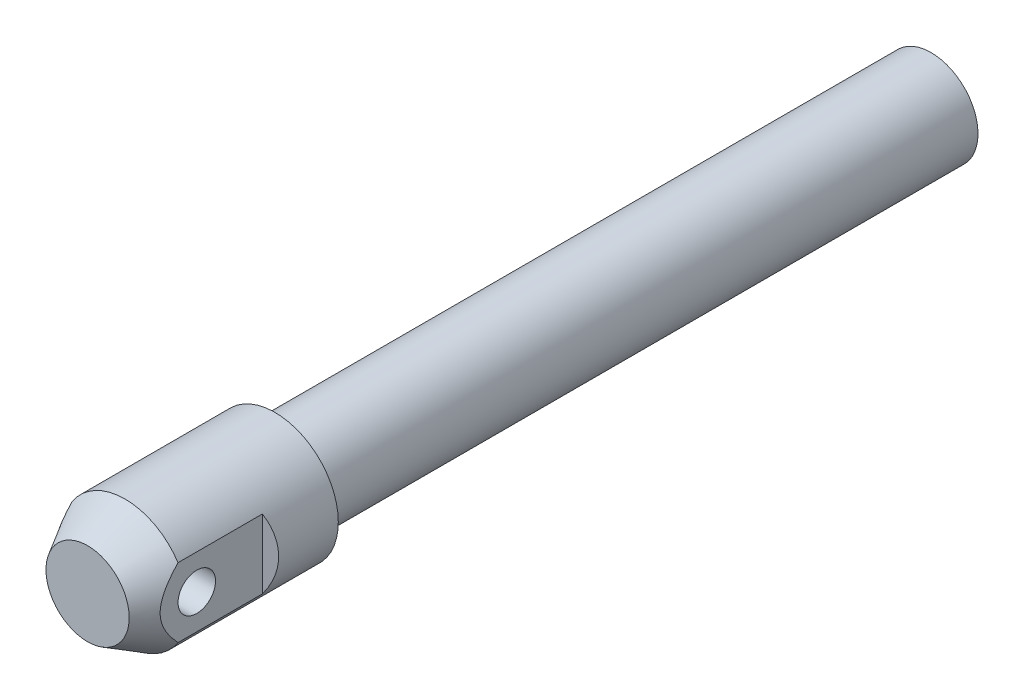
ISO-10303-21;
HEADER;
FILE_DESCRIPTION(('STEP AP214'),'2;1');
FILE_NAME('part.step','',(''),(''),'','','');
FILE_SCHEMA(('AUTOMOTIVE_DESIGN { 1 0 10303 214 1 1 1 1 }'));
ENDSEC;
DATA;
#1=APPLICATION_CONTEXT('core data for automotive mechanical design processes');
#2=APPLICATION_PROTOCOL_DEFINITION('international standard','automotive_design',2000,#1);
#3=PRODUCT_CONTEXT('',#1,'mechanical');
#4=PRODUCT('Part','Part','',(#3));
#5=PRODUCT_RELATED_PRODUCT_CATEGORY('part','',(#4));
#6=PRODUCT_DEFINITION_FORMATION('','',#4);
#7=PRODUCT_DEFINITION_CONTEXT('part definition',#1,'design');
#8=PRODUCT_DEFINITION('design','',#6,#7);
#9=PRODUCT_DEFINITION_SHAPE('','',#8);
#10=(LENGTH_UNIT() NAMED_UNIT(*) SI_UNIT(.MILLI.,.METRE.));
#11=(NAMED_UNIT(*) PLANE_ANGLE_UNIT() SI_UNIT($,.RADIAN.));
#12=(NAMED_UNIT(*) SI_UNIT($,.STERADIAN.) SOLID_ANGLE_UNIT());
#13=UNCERTAINTY_MEASURE_WITH_UNIT(LENGTH_MEASURE(1.E-05),#10,'distance_accuracy_value','');
#14=(GEOMETRIC_REPRESENTATION_CONTEXT(3) GLOBAL_UNCERTAINTY_ASSIGNED_CONTEXT((#13)) GLOBAL_UNIT_ASSIGNED_CONTEXT((#10,
#11,#12)) REPRESENTATION_CONTEXT('',''));
#15=CARTESIAN_POINT('',(0.,0.,0.));
#16=DIRECTION('',(0.,0.,1.));
#17=DIRECTION('',(1.,0.,0.));
#18=AXIS2_PLACEMENT_3D('',#15,#16,#17);
#19=CARTESIAN_POINT('',(0.,0.,20.));
#20=DIRECTION('',(0.,0.,1.));
#21=DIRECTION('',(1.,0.,0.));
#22=AXIS2_PLACEMENT_3D('',#19,#20,#21);
#23=CYLINDRICAL_SURFACE('',#22,13.5);
#24=CARTESIAN_POINT('',(0.,0.,0.));
#25=DIRECTION('',(0.,0.,1.));
#26=DIRECTION('',(1.,0.,0.));
#27=AXIS2_PLACEMENT_3D('',#24,#25,#26);
#28=CIRCLE('',#27,13.5);
#29=CARTESIAN_POINT('',(13.5,0.,0.));
#30=VERTEX_POINT('',#29);
#31=EDGE_CURVE('E82',#30,#30,#28,.T.);
#32=ORIENTED_EDGE('',*,*,#31,.T.);
#33=EDGE_LOOP('',(#32));
#34=FACE_BOUND('',#33,.T.);
#35=CARTESIAN_POINT('',(0.,0.,32.));
#36=DIRECTION('',(0.,0.,1.));
#37=DIRECTION('',(1.,0.,0.));
#38=AXIS2_PLACEMENT_3D('',#35,#36,#37);
#39=CIRCLE('',#38,13.5);
#40=CARTESIAN_POINT('',(-11.3,-7.38647412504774,32.));
#41=VERTEX_POINT('',#40);
#42=CARTESIAN_POINT('',(11.3,-7.38647412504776,32.));
#43=VERTEX_POINT('',#42);
#44=EDGE_CURVE('E67',#41,#43,#39,.T.);
#45=ORIENTED_EDGE('',*,*,#44,.F.);
#46=DIRECTION('',(0.,0.,1.));
#47=VECTOR('',#46,1.);
#48=CARTESIAN_POINT('',(-11.3,-7.38647412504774,20.));
#49=LINE('',#48,#47);
#50=CARTESIAN_POINT('',(-11.3,-7.38647412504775,14.));
#51=VERTEX_POINT('',#50);
#52=EDGE_CURVE('E30',#41,#51,#49,.F.);
#53=ORIENTED_EDGE('',*,*,#52,.T.);
#54=CARTESIAN_POINT('',(0.,0.,20.5240580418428));
#55=DIRECTION('',(0.5,0.,-0.866025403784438));
#56=DIRECTION('',(0.866025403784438,0.,0.5));
#57=AXIS2_PLACEMENT_3D('',#54,#55,#56);
#58=ELLIPSE('',#57,15.5884572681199,13.5);
#59=CARTESIAN_POINT('',(-11.3,7.38647412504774,14.));
#60=VERTEX_POINT('',#59);
#61=EDGE_CURVE('E9',#60,#51,#58,.F.);
#62=ORIENTED_EDGE('',*,*,#61,.F.);
#63=DIRECTION('',(0.,0.,1.));
#64=VECTOR('',#63,1.);
#65=CARTESIAN_POINT('',(-11.3,7.38647412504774,20.));
#66=LINE('',#65,#64);
#67=CARTESIAN_POINT('',(-11.3,7.38647412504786,32.));
#68=VERTEX_POINT('',#67);
#69=EDGE_CURVE('E63',#60,#68,#66,.T.);
#70=ORIENTED_EDGE('',*,*,#69,.T.);
#71=CARTESIAN_POINT('',(11.3,7.38647412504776,32.));
#72=VERTEX_POINT('',#71);
#73=EDGE_CURVE('E79',#72,#68,#39,.T.);
#74=ORIENTED_EDGE('',*,*,#73,.F.);
#75=DIRECTION('',(0.,0.,1.));
#76=VECTOR('',#75,1.);
#77=CARTESIAN_POINT('',(11.3,7.38647412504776,20.));
#78=LINE('',#77,#76);
#79=CARTESIAN_POINT('',(11.3,7.38647412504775,14.));
#80=VERTEX_POINT('',#79);
#81=EDGE_CURVE('E38',#80,#72,#78,.T.);
#82=ORIENTED_EDGE('',*,*,#81,.F.);
#83=CARTESIAN_POINT('',(0.,0.,20.5240580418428));
#84=DIRECTION('',(0.5,0.,0.866025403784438));
#85=DIRECTION('',(-0.866025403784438,0.,0.5));
#86=AXIS2_PLACEMENT_3D('',#83,#84,#85);
#87=ELLIPSE('',#86,15.5884572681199,13.5);
#88=CARTESIAN_POINT('',(11.3,-7.38647412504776,14.));
#89=VERTEX_POINT('',#88);
#90=EDGE_CURVE('E99',#80,#89,#87,.F.);
#91=ORIENTED_EDGE('',*,*,#90,.T.);
#92=DIRECTION('',(0.,0.,1.));
#93=VECTOR('',#92,1.);
#94=CARTESIAN_POINT('',(11.3,-7.38647412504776,20.));
#95=LINE('',#94,#93);
#96=EDGE_CURVE('E74',#43,#89,#95,.F.);
#97=ORIENTED_EDGE('',*,*,#96,.F.);
#98=EDGE_LOOP('',(#45,#53,#62,#70,#74,#82,#91,#97));
#99=FACE_BOUND('',#98,.T.);
#100=ADVANCED_FACE('F14',(#34,#99),#23,.T.);
#101=CARTESIAN_POINT('',(0.,0.,40.));
#102=DIRECTION('',(0.,0.,-1.));
#103=DIRECTION('',(-1.,0.,0.));
#104=AXIS2_PLACEMENT_3D('',#101,#102,#103);
#105=CONICAL_SURFACE('',#104,8.88119784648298,0.523598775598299);
#106=CARTESIAN_POINT('',(0.,0.,40.));
#107=DIRECTION('',(0.,0.,1.));
#108=DIRECTION('',(1.,0.,0.));
#109=AXIS2_PLACEMENT_3D('',#106,#107,#108);
#110=CIRCLE('',#109,8.88119784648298);
#111=CARTESIAN_POINT('',(8.88119784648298,0.,40.));
#112=VERTEX_POINT('',#111);
#113=EDGE_CURVE('E76',#112,#112,#110,.T.);
#114=ORIENTED_EDGE('',*,*,#113,.F.);
#115=EDGE_LOOP('',(#114));
#116=FACE_BOUND('',#115,.T.);
#117=ORIENTED_EDGE('',*,*,#73,.T.);
#118=CARTESIAN_POINT('',(-11.3,-18.8347178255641,17.3391610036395));
#119=CARTESIAN_POINT('',(-11.3,-18.6312428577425,17.6413684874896));
#120=CARTESIAN_POINT('',(-11.3,-18.4271713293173,17.9431740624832));
#121=CARTESIAN_POINT('',(-11.3,-18.0177145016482,18.5458952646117));
#122=CARTESIAN_POINT('',(-11.3,-17.8123291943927,18.8468108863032));
#123=CARTESIAN_POINT('',(-11.3,-17.1939628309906,19.7481792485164));
#124=CARTESIAN_POINT('',(-11.3,-16.7788329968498,20.3471617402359));
#125=CARTESIAN_POINT('',(-11.3,-15.9388099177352,21.5443219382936));
#126=CARTESIAN_POINT('',(-11.3,-15.5138695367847,22.1424666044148));
#127=CARTESIAN_POINT('',(-11.3,-14.6554077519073,23.3325086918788));
#128=CARTESIAN_POINT('',(-11.3,-14.2218871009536,23.9244066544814));
#129=CARTESIAN_POINT('',(-11.3,-13.5436857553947,24.8328000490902));
#130=CARTESIAN_POINT('',(-11.3,-13.3027889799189,25.1521216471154));
#131=CARTESIAN_POINT('',(-11.3,-12.817342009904,25.7879734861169));
#132=CARTESIAN_POINT('',(-11.3,-12.5727918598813,26.1045037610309));
#133=CARTESIAN_POINT('',(-11.3,-12.0794340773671,26.7343911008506));
#134=CARTESIAN_POINT('',(-11.3,-11.8306251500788,27.0477471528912));
#135=CARTESIAN_POINT('',(-11.3,-11.3281887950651,27.6705730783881));
#136=CARTESIAN_POINT('',(-11.3,-11.0745614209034,27.9800429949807));
#137=CARTESIAN_POINT('',(-11.3,-10.562504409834,28.5933750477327));
#138=CARTESIAN_POINT('',(-11.3,-10.3040919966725,28.8972515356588));
#139=CARTESIAN_POINT('',(-11.3,-9.78075923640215,29.4993915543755));
#140=CARTESIAN_POINT('',(-11.3,-9.51583855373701,29.7976547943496));
#141=CARTESIAN_POINT('',(-11.3,-8.97850518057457,30.3870660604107));
#142=CARTESIAN_POINT('',(-11.3,-8.70609677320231,30.6782179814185));
#143=CARTESIAN_POINT('',(-11.3,-8.15226385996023,31.2517878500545));
#144=CARTESIAN_POINT('',(-11.3,-7.87084075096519,31.5342071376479));
#145=CARTESIAN_POINT('',(-11.3,-7.43161505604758,31.9581511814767));
#146=CARTESIAN_POINT('',(-11.3,-7.27767803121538,32.1036859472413));
#147=CARTESIAN_POINT('',(-11.3,-6.96643973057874,32.3911264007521));
#148=CARTESIAN_POINT('',(-11.3,-6.80913839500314,32.5330320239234));
#149=CARTESIAN_POINT('',(-11.3,-6.49073908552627,32.8127380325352));
#150=CARTESIAN_POINT('',(-11.3,-6.32963877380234,32.950535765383));
#151=CARTESIAN_POINT('',(-11.3,-6.00337830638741,33.2212274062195));
#152=CARTESIAN_POINT('',(-11.3,-5.83821820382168,33.3541213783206));
#153=CARTESIAN_POINT('',(-11.3,-5.33951549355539,33.7415816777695));
#154=CARTESIAN_POINT('',(-11.3,-4.99944271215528,33.9878762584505));
#155=CARTESIAN_POINT('',(-11.3,-4.29895012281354,34.4494867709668));
#156=CARTESIAN_POINT('',(-11.3,-3.93855400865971,34.6648377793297));
#157=CARTESIAN_POINT('',(-11.3,-3.3812134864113,34.9553996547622));
#158=CARTESIAN_POINT('',(-11.3,-3.19269992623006,35.0468208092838));
#159=CARTESIAN_POINT('',(-11.3,-2.80999688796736,35.2169818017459));
#160=CARTESIAN_POINT('',(-11.3,-2.61580786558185,35.2957226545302));
#161=CARTESIAN_POINT('',(-11.3,-2.22226428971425,35.4384010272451));
#162=CARTESIAN_POINT('',(-11.3,-2.02291566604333,35.5023547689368));
#163=CARTESIAN_POINT('',(-11.3,-1.61961078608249,35.6135025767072));
#164=CARTESIAN_POINT('',(-11.3,-1.41565578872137,35.660701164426));
#165=CARTESIAN_POINT('',(-11.3,-1.00178639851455,35.7370181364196));
#166=CARTESIAN_POINT('',(-11.3,-0.791829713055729,35.7659099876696));
#167=CARTESIAN_POINT('',(-11.3,-0.370107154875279,35.8034123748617));
#168=CARTESIAN_POINT('',(-11.3,-0.158341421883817,35.8120244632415));
#169=CARTESIAN_POINT('',(-11.3,0.264860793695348,35.8085643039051));
#170=CARTESIAN_POINT('',(-11.3,0.476297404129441,35.7965076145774));
#171=CARTESIAN_POINT('',(-11.3,0.89705334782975,35.752308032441));
#172=CARTESIAN_POINT('',(-11.3,1.10637243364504,35.7201628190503));
#173=CARTESIAN_POINT('',(-11.3,1.54335102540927,35.6327533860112));
#174=CARTESIAN_POINT('',(-11.3,1.77058831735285,35.5753907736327));
#175=CARTESIAN_POINT('',(-11.3,2.21897916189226,35.4403905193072));
#176=CARTESIAN_POINT('',(-11.3,2.44013000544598,35.3627440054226));
#177=CARTESIAN_POINT('',(-11.3,2.87756331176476,35.1892771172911));
#178=CARTESIAN_POINT('',(-11.3,3.09377912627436,35.0932902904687));
#179=CARTESIAN_POINT('',(-11.3,3.51889359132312,34.8865164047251));
#180=CARTESIAN_POINT('',(-11.3,3.72779359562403,34.7757321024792));
#181=CARTESIAN_POINT('',(-11.3,4.17858760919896,34.5190685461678));
#182=CARTESIAN_POINT('',(-11.3,4.41897628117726,34.3705576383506));
#183=CARTESIAN_POINT('',(-11.3,4.89052940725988,34.0594779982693));
#184=CARTESIAN_POINT('',(-11.3,5.12169003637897,33.8969035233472));
#185=CARTESIAN_POINT('',(-11.3,5.57632851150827,33.5600071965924));
#186=CARTESIAN_POINT('',(-11.3,5.7997808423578,33.3856511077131));
#187=CARTESIAN_POINT('',(-11.3,6.23918051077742,33.0278349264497));
#188=CARTESIAN_POINT('',(-11.3,6.45512894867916,32.8443761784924));
#189=CARTESIAN_POINT('',(-11.3,6.87086380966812,32.4784380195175));
#190=CARTESIAN_POINT('',(-11.3,7.07094011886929,32.2962865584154));
#191=CARTESIAN_POINT('',(-11.3,7.46579297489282,31.9263110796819));
#192=CARTESIAN_POINT('',(-11.3,7.66056910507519,31.7384866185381));
#193=CARTESIAN_POINT('',(-11.3,8.04396867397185,31.359521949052));
#194=CARTESIAN_POINT('',(-11.3,8.23262736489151,31.168417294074));
#195=CARTESIAN_POINT('',(-11.3,8.60576056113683,30.7822648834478));
#196=CARTESIAN_POINT('',(-11.3,8.79023621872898,30.5872182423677));
#197=CARTESIAN_POINT('',(-11.3,8.97289829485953,30.3905128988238));
#198=B_SPLINE_CURVE_WITH_KNOTS('',3,(#118,#119,#120,#121,#122,#123,#124,#125,#126,#127,#128,
#129,#130,#131,#132,#133,#134,#135,#136,#137,#138,#139,#140,#141,#142,#143,#144,#145,#146,#147,
#148,#149,#150,#151,#152,#153,#154,#155,#156,#157,#158,#159,#160,#161,#162,#163,#164,#165,#166,
#167,#168,#169,#170,#171,#172,#173,#174,#175,#176,#177,#178,#179,#180,#181,#182,#183,#184,#185,
#186,#187,#188,#189,#190,#191,#192,#193,#194,#195,#196,#197),.UNSPECIFIED.,.F.,.F.,(4,2,2,2,2,2,
2,2,2,2,2,2,2,2,2,2,2,2,2,2,2,2,2,2,2,2,2,2,2,2,2,2,2,2,2,2,2,2,2,4),(0.,1.09296825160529,
2.18594317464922,4.37222463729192,6.57334120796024,8.77426546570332,9.97423505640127,
11.1741900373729,12.3745165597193,13.5748297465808,14.7714409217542,15.9681139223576,
17.1641160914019,18.3599338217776,18.9954120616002,19.6309016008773,20.2667929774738,
20.9026760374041,22.1611709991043,23.418227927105,24.0463884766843,24.6744987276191,
25.301916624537,25.9291650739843,26.5640310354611,27.1988483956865,27.833188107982,
28.4676011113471,29.1696109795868,29.8719284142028,30.5809518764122,31.2898434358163,
32.1369066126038,32.9843173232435,33.8343063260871,34.6841701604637,35.4957618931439,
36.3074172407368,37.1129692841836,37.9182966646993),.UNSPECIFIED.);
#199=EDGE_CURVE('E23',#68,#41,#198,.F.);
#200=ORIENTED_EDGE('',*,*,#199,.T.);
#201=ORIENTED_EDGE('',*,*,#44,.T.);
#202=CARTESIAN_POINT('',(11.3,-18.8347178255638,17.3391610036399));
#203=CARTESIAN_POINT('',(11.3,-18.6312428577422,17.6413684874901));
#204=CARTESIAN_POINT('',(11.3,-18.4271713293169,17.9431740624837));
#205=CARTESIAN_POINT('',(11.3,-18.0177145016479,18.5458952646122));
#206=CARTESIAN_POINT('',(11.3,-17.8123291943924,18.8468108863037));
#207=CARTESIAN_POINT('',(11.3,-17.1939628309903,19.7481792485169));
#208=CARTESIAN_POINT('',(11.3,-16.7788329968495,20.3471617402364));
#209=CARTESIAN_POINT('',(11.3,-15.9388099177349,21.544321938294));
#210=CARTESIAN_POINT('',(11.3,-15.5138695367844,22.1424666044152));
#211=CARTESIAN_POINT('',(11.3,-14.655407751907,23.3325086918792));
#212=CARTESIAN_POINT('',(11.3,-14.2218871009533,23.9244066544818));
#213=CARTESIAN_POINT('',(11.3,-13.5436857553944,24.8328000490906));
#214=CARTESIAN_POINT('',(11.3,-13.3027889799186,25.1521216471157));
#215=CARTESIAN_POINT('',(11.3,-12.8173420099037,25.7879734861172));
#216=CARTESIAN_POINT('',(11.3,-12.5727918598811,26.1045037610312));
#217=CARTESIAN_POINT('',(11.3,-12.0794340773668,26.7343911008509));
#218=CARTESIAN_POINT('',(11.3,-11.8306251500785,27.0477471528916));
#219=CARTESIAN_POINT('',(11.3,-11.3281887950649,27.6705730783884));
#220=CARTESIAN_POINT('',(11.3,-11.0745614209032,27.980042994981));
#221=CARTESIAN_POINT('',(11.3,-10.5625044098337,28.593375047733));
#222=CARTESIAN_POINT('',(11.3,-10.3040919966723,28.8972515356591));
#223=CARTESIAN_POINT('',(11.3,-9.78075923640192,29.4993915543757));
#224=CARTESIAN_POINT('',(11.3,-9.51583855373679,29.7976547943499));
#225=CARTESIAN_POINT('',(11.3,-8.97850518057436,30.3870660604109));
#226=CARTESIAN_POINT('',(11.3,-8.70609677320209,30.6782179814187));
#227=CARTESIAN_POINT('',(11.3,-8.15226385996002,31.2517878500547));
#228=CARTESIAN_POINT('',(11.3,-7.87084075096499,31.5342071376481));
#229=CARTESIAN_POINT('',(11.3,-7.4316150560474,31.9581511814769));
#230=CARTESIAN_POINT('',(11.3,-7.27767803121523,32.1036859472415));
#231=CARTESIAN_POINT('',(11.3,-6.96643973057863,32.3911264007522));
#232=CARTESIAN_POINT('',(11.3,-6.80913839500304,32.5330320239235));
#233=CARTESIAN_POINT('',(11.3,-6.49073908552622,32.8127380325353));
#234=CARTESIAN_POINT('',(11.3,-6.3296387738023,32.950535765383));
#235=CARTESIAN_POINT('',(11.3,-6.00337830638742,33.2212274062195));
#236=CARTESIAN_POINT('',(11.3,-5.83821820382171,33.3541213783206));
#237=CARTESIAN_POINT('',(11.3,-5.33951549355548,33.7415816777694));
#238=CARTESIAN_POINT('',(11.3,-4.99944271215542,33.9878762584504));
#239=CARTESIAN_POINT('',(11.3,-4.2989501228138,34.4494867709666));
#240=CARTESIAN_POINT('',(11.3,-3.93855400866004,34.6648377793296));
#241=CARTESIAN_POINT('',(11.3,-3.38121348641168,34.955399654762));
#242=CARTESIAN_POINT('',(11.3,-3.19269992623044,35.0468208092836));
#243=CARTESIAN_POINT('',(11.3,-2.80999688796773,35.2169818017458));
#244=CARTESIAN_POINT('',(11.3,-2.61580786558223,35.2957226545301));
#245=CARTESIAN_POINT('',(11.3,-2.22226428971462,35.438401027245));
#246=CARTESIAN_POINT('',(11.3,-2.0229156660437,35.5023547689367));
#247=CARTESIAN_POINT('',(11.3,-1.61961078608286,35.6135025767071));
#248=CARTESIAN_POINT('',(11.3,-1.41565578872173,35.6607011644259));
#249=CARTESIAN_POINT('',(11.3,-1.0017863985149,35.7370181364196));
#250=CARTESIAN_POINT('',(11.3,-0.791829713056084,35.7659099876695));
#251=CARTESIAN_POINT('',(11.3,-0.370107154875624,35.8034123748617));
#252=CARTESIAN_POINT('',(11.3,-0.158341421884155,35.8120244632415));
#253=CARTESIAN_POINT('',(11.3,0.26486079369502,35.8085643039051));
#254=CARTESIAN_POINT('',(11.3,0.476297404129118,35.7965076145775));
#255=CARTESIAN_POINT('',(11.3,0.897053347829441,35.7523080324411));
#256=CARTESIAN_POINT('',(11.3,1.10637243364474,35.7201628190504));
#257=CARTESIAN_POINT('',(11.3,1.54335102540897,35.6327533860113));
#258=CARTESIAN_POINT('',(11.3,1.77058831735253,35.5753907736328));
#259=CARTESIAN_POINT('',(11.3,2.21897916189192,35.4403905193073));
#260=CARTESIAN_POINT('',(11.3,2.44013000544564,35.3627440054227));
#261=CARTESIAN_POINT('',(11.3,2.8775633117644,35.1892771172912));
#262=CARTESIAN_POINT('',(11.3,3.09377912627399,35.0932902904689));
#263=CARTESIAN_POINT('',(11.3,3.51889359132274,34.8865164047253));
#264=CARTESIAN_POINT('',(11.3,3.72779359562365,34.7757321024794));
#265=CARTESIAN_POINT('',(11.3,4.17858760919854,34.5190685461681));
#266=CARTESIAN_POINT('',(11.3,4.4189762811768,34.3705576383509));
#267=CARTESIAN_POINT('',(11.3,4.89052940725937,34.0594779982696));
#268=CARTESIAN_POINT('',(11.3,5.12169003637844,33.8969035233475));
#269=CARTESIAN_POINT('',(11.3,5.5763285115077,33.5600071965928));
#270=CARTESIAN_POINT('',(11.3,5.7997808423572,33.3856511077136));
#271=CARTESIAN_POINT('',(11.3,6.23918051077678,33.0278349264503));
#272=CARTESIAN_POINT('',(11.3,6.45512894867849,32.8443761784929));
#273=CARTESIAN_POINT('',(11.3,6.87086380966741,32.4784380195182));
#274=CARTESIAN_POINT('',(11.3,7.07094011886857,32.2962865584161));
#275=CARTESIAN_POINT('',(11.3,7.46579297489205,31.9263110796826));
#276=CARTESIAN_POINT('',(11.3,7.6605691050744,31.7384866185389));
#277=CARTESIAN_POINT('',(11.3,8.04396867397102,31.3595219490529));
#278=CARTESIAN_POINT('',(11.3,8.23262736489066,31.1684172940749));
#279=CARTESIAN_POINT('',(11.3,8.60576056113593,30.7822648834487));
#280=CARTESIAN_POINT('',(11.3,8.79023621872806,30.5872182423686));
#281=CARTESIAN_POINT('',(11.3,8.97289829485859,30.3905128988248));
#282=B_SPLINE_CURVE_WITH_KNOTS('',3,(#202,#203,#204,#205,#206,#207,#208,#209,#210,#211,#212,
#213,#214,#215,#216,#217,#218,#219,#220,#221,#222,#223,#224,#225,#226,#227,#228,#229,#230,#231,
#232,#233,#234,#235,#236,#237,#238,#239,#240,#241,#242,#243,#244,#245,#246,#247,#248,#249,#250,
#251,#252,#253,#254,#255,#256,#257,#258,#259,#260,#261,#262,#263,#264,#265,#266,#267,#268,#269,
#270,#271,#272,#273,#274,#275,#276,#277,#278,#279,#280,#281),.UNSPECIFIED.,.F.,.F.,(4,2,2,2,2,2,
2,2,2,2,2,2,2,2,2,2,2,2,2,2,2,2,2,2,2,2,2,2,2,2,2,2,2,2,2,2,2,2,2,4),(0.,1.09296825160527,
2.18594317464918,4.37222463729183,6.57334120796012,8.77426546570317,9.97423505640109,
11.1741900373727,12.3745165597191,13.5748297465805,14.7714409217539,15.9681139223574,
17.1641160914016,18.3599338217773,18.9954120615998,19.6309016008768,20.2667929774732,
20.9026760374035,22.1611709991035,23.4182279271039,24.0463884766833,24.6744987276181,
25.3019166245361,25.9291650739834,26.5640310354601,27.1988483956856,27.8331881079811,
28.4676011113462,29.1696109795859,29.8719284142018,30.5809518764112,31.2898434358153,
32.1369066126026,32.9843173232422,33.8343063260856,34.6841701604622,35.4957618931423,
36.307417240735,37.1129692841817,37.9182966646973),.UNSPECIFIED.);
#283=EDGE_CURVE('E91',#72,#43,#282,.F.);
#284=ORIENTED_EDGE('',*,*,#283,.F.);
#285=EDGE_LOOP('',(#117,#200,#201,#284));
#286=FACE_BOUND('',#285,.T.);
#287=ADVANCED_FACE('F104',(#116,#286),#105,.T.);
#288=CARTESIAN_POINT('',(0.,8.88119784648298,40.));
#289=DIRECTION('',(0.,0.,-1.));
#290=DIRECTION('',(-1.,0.,0.));
#291=AXIS2_PLACEMENT_3D('',#288,#289,#290);
#292=PLANE('',#291);
#293=ORIENTED_EDGE('',*,*,#113,.T.);
#294=EDGE_LOOP('',(#293));
#295=FACE_BOUND('',#294,.T.);
#296=ADVANCED_FACE('F16',(#295),#292,.F.);
#297=CARTESIAN_POINT('',(0.,10.,-140.));
#298=DIRECTION('',(0.,0.,-1.));
#299=DIRECTION('',(-1.,0.,0.));
#300=AXIS2_PLACEMENT_3D('',#297,#298,#299);
#301=PLANE('',#300);
#302=CARTESIAN_POINT('',(0.,0.,-140.));
#303=DIRECTION('',(0.,0.,1.));
#304=DIRECTION('',(1.,0.,0.));
#305=AXIS2_PLACEMENT_3D('',#302,#303,#304);
#306=CIRCLE('',#305,10.);
#307=CARTESIAN_POINT('',(10.,0.,-140.));
#308=VERTEX_POINT('',#307);
#309=EDGE_CURVE('E88',#308,#308,#306,.T.);
#310=ORIENTED_EDGE('',*,*,#309,.F.);
#311=EDGE_LOOP('',(#310));
#312=FACE_BOUND('',#311,.T.);
#313=ADVANCED_FACE('F147',(#312),#301,.T.);
#314=CARTESIAN_POINT('',(0.,0.,20.));
#315=DIRECTION('',(0.,0.,1.));
#316=DIRECTION('',(1.,0.,0.));
#317=AXIS2_PLACEMENT_3D('',#314,#315,#316);
#318=CYLINDRICAL_SURFACE('',#317,10.);
#319=ORIENTED_EDGE('',*,*,#309,.T.);
#320=EDGE_LOOP('',(#319));
#321=FACE_BOUND('',#320,.T.);
#322=CARTESIAN_POINT('',(0.,0.,0.));
#323=DIRECTION('',(0.,0.,1.));
#324=DIRECTION('',(1.,0.,0.));
#325=AXIS2_PLACEMENT_3D('',#322,#323,#324);
#326=CIRCLE('',#325,10.);
#327=CARTESIAN_POINT('',(10.,0.,0.));
#328=VERTEX_POINT('',#327);
#329=EDGE_CURVE('E85',#328,#328,#326,.T.);
#330=ORIENTED_EDGE('',*,*,#329,.F.);
#331=EDGE_LOOP('',(#330));
#332=FACE_BOUND('',#331,.T.);
#333=ADVANCED_FACE('F134',(#321,#332),#318,.T.);
#334=CARTESIAN_POINT('',(0.,10.,0.));
#335=DIRECTION('',(0.,0.,1.));
#336=DIRECTION('',(1.,0.,0.));
#337=AXIS2_PLACEMENT_3D('',#334,#335,#336);
#338=PLANE('',#337);
#339=ORIENTED_EDGE('',*,*,#31,.F.);
#340=EDGE_LOOP('',(#339));
#341=FACE_BOUND('',#340,.T.);
#342=ORIENTED_EDGE('',*,*,#329,.T.);
#343=EDGE_LOOP('',(#342));
#344=FACE_BOUND('',#343,.T.);
#345=ADVANCED_FACE('F125',(#341,#344),#338,.F.);
#346=CARTESIAN_POINT('',(11.3,-15.,14.));
#347=DIRECTION('',(0.5,0.,0.866025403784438));
#348=DIRECTION('',(0.866025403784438,0.,-0.5));
#349=AXIS2_PLACEMENT_3D('',#346,#347,#348);
#350=PLANE('',#349);
#351=DIRECTION('',(0.,1.,0.));
#352=VECTOR('',#351,1.);
#353=CARTESIAN_POINT('',(11.3,-15.,14.));
#354=LINE('',#353,#352);
#355=EDGE_CURVE('E68',#89,#80,#354,.T.);
#356=ORIENTED_EDGE('',*,*,#355,.F.);
#357=ORIENTED_EDGE('',*,*,#90,.F.);
#358=EDGE_LOOP('',(#356,#357));
#359=FACE_BOUND('',#358,.T.);
#360=ADVANCED_FACE('F123',(#359),#350,.T.);
#361=CARTESIAN_POINT('',(11.3,-15.,14.));
#362=DIRECTION('',(-1.,0.,0.));
#363=DIRECTION('',(0.,0.,1.));
#364=AXIS2_PLACEMENT_3D('',#361,#362,#363);
#365=PLANE('',#364);
#366=CARTESIAN_POINT('',(11.3,0.,28.));
#367=DIRECTION('',(1.,0.,0.));
#368=DIRECTION('',(0.,0.,-1.));
#369=AXIS2_PLACEMENT_3D('',#366,#367,#368);
#370=CIRCLE('',#369,4.);
#371=CARTESIAN_POINT('',(11.3,0.,24.));
#372=VERTEX_POINT('',#371);
#373=EDGE_CURVE('E233',#372,#372,#370,.T.);
#374=ORIENTED_EDGE('',*,*,#373,.F.);
#375=EDGE_LOOP('',(#374));
#376=FACE_BOUND('',#375,.T.);
#377=ORIENTED_EDGE('',*,*,#96,.T.);
#378=ORIENTED_EDGE('',*,*,#355,.T.);
#379=ORIENTED_EDGE('',*,*,#81,.T.);
#380=ORIENTED_EDGE('',*,*,#283,.T.);
#381=EDGE_LOOP('',(#377,#378,#379,#380));
#382=FACE_BOUND('',#381,.T.);
#383=ADVANCED_FACE('F101',(#376,#382),#365,.F.);
#384=CARTESIAN_POINT('',(-11.3,-15.,14.));
#385=DIRECTION('',(-1.,0.,0.));
#386=DIRECTION('',(0.,0.,1.));
#387=AXIS2_PLACEMENT_3D('',#384,#385,#386);
#388=PLANE('',#387);
#389=CARTESIAN_POINT('',(-11.3,0.,28.));
#390=DIRECTION('',(-1.,0.,0.));
#391=DIRECTION('',(0.,0.,1.));
#392=AXIS2_PLACEMENT_3D('',#389,#390,#391);
#393=CIRCLE('',#392,4.);
#394=CARTESIAN_POINT('',(-11.3,0.,32.));
#395=VERTEX_POINT('',#394);
#396=EDGE_CURVE('E18',#395,#395,#393,.T.);
#397=ORIENTED_EDGE('',*,*,#396,.F.);
#398=EDGE_LOOP('',(#397));
#399=FACE_BOUND('',#398,.T.);
#400=ORIENTED_EDGE('',*,*,#199,.F.);
#401=ORIENTED_EDGE('',*,*,#69,.F.);
#402=DIRECTION('',(0.,1.,0.));
#403=VECTOR('',#402,1.);
#404=CARTESIAN_POINT('',(-11.3,-15.,14.));
#405=LINE('',#404,#403);
#406=EDGE_CURVE('E59',#51,#60,#405,.T.);
#407=ORIENTED_EDGE('',*,*,#406,.F.);
#408=ORIENTED_EDGE('',*,*,#52,.F.);
#409=EDGE_LOOP('',(#400,#401,#407,#408));
#410=FACE_BOUND('',#409,.T.);
#411=ADVANCED_FACE('F62',(#399,#410),#388,.T.);
#412=CARTESIAN_POINT('',(-11.3,-15.,14.));
#413=DIRECTION('',(0.5,0.,-0.866025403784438));
#414=DIRECTION('',(-0.866025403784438,0.,-0.5));
#415=AXIS2_PLACEMENT_3D('',#412,#413,#414);
#416=PLANE('',#415);
#417=ORIENTED_EDGE('',*,*,#61,.T.);
#418=ORIENTED_EDGE('',*,*,#406,.T.);
#419=EDGE_LOOP('',(#417,#418));
#420=FACE_BOUND('',#419,.T.);
#421=ADVANCED_FACE('F58',(#420),#416,.F.);
#422=CARTESIAN_POINT('',(-13.5,0.,28.));
#423=DIRECTION('',(1.,0.,0.));
#424=DIRECTION('',(0.,0.,-1.));
#425=AXIS2_PLACEMENT_3D('',#422,#423,#424);
#426=CYLINDRICAL_SURFACE('',#425,4.);
#427=ORIENTED_EDGE('',*,*,#396,.T.);
#428=EDGE_LOOP('',(#427));
#429=FACE_BOUND('',#428,.T.);
#430=ORIENTED_EDGE('',*,*,#373,.T.);
#431=EDGE_LOOP('',(#430));
#432=FACE_BOUND('',#431,.T.);
#433=ADVANCED_FACE('F121',(#429,#432),#426,.F.);
#434=CLOSED_SHELL('',(#100,#287,#296,#313,#333,#345,#360,#383,#411,#421,#433));
#435=MANIFOLD_SOLID_BREP('B1',#434);
#436=ADVANCED_BREP_SHAPE_REPRESENTATION('',(#18,#435),#14);
#437=SHAPE_DEFINITION_REPRESENTATION(#9,#436);
ENDSEC;
END-ISO-10303-21;
